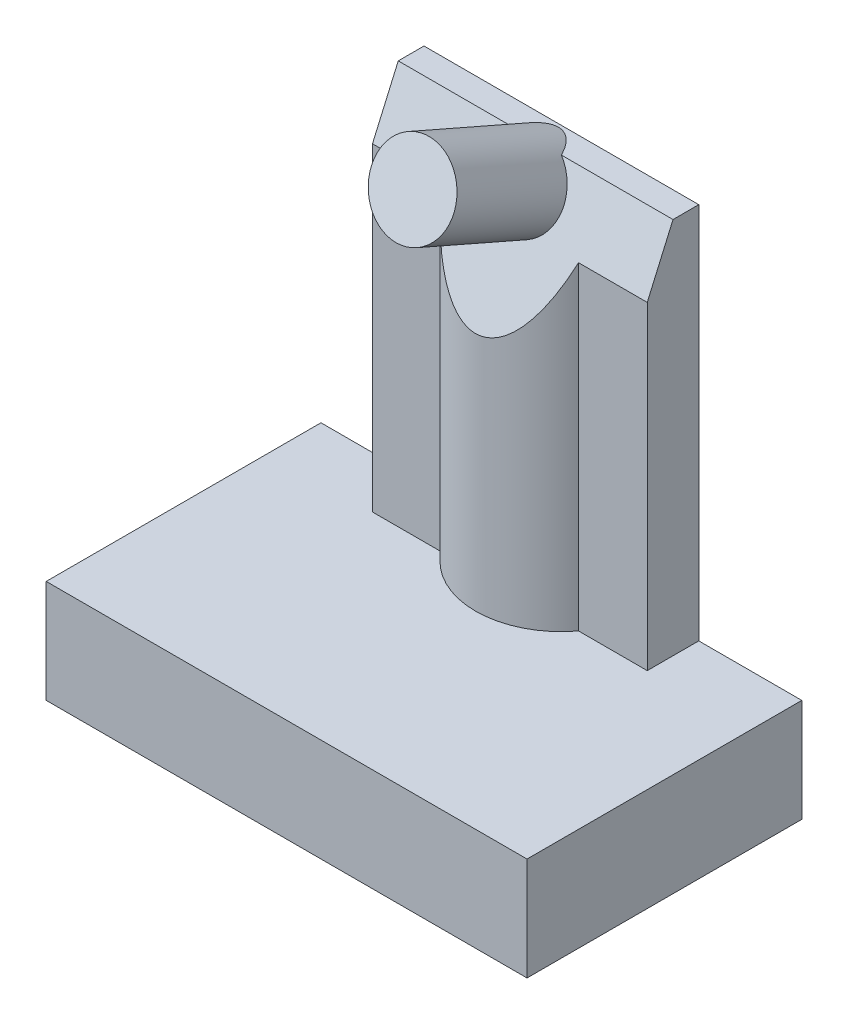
ISO-10303-21;
HEADER;
FILE_DESCRIPTION(('STEP AP214'),'2;1');
FILE_NAME('part.step','',(''),(''),'','','');
FILE_SCHEMA(('AUTOMOTIVE_DESIGN { 1 0 10303 214 1 1 1 1 }'));
ENDSEC;
DATA;
#1=APPLICATION_CONTEXT('core data for automotive mechanical design processes');
#2=APPLICATION_PROTOCOL_DEFINITION('international standard','automotive_design',2000,#1);
#3=PRODUCT_CONTEXT('',#1,'mechanical');
#4=PRODUCT('Part','Part','',(#3));
#5=PRODUCT_RELATED_PRODUCT_CATEGORY('part','',(#4));
#6=PRODUCT_DEFINITION_FORMATION('','',#4);
#7=PRODUCT_DEFINITION_CONTEXT('part definition',#1,'design');
#8=PRODUCT_DEFINITION('design','',#6,#7);
#9=PRODUCT_DEFINITION_SHAPE('','',#8);
#10=(LENGTH_UNIT() NAMED_UNIT(*) SI_UNIT(.MILLI.,.METRE.));
#11=(NAMED_UNIT(*) PLANE_ANGLE_UNIT() SI_UNIT($,.RADIAN.));
#12=(NAMED_UNIT(*) SI_UNIT($,.STERADIAN.) SOLID_ANGLE_UNIT());
#13=UNCERTAINTY_MEASURE_WITH_UNIT(LENGTH_MEASURE(1.E-05),#10,'distance_accuracy_value','');
#14=(GEOMETRIC_REPRESENTATION_CONTEXT(3) GLOBAL_UNCERTAINTY_ASSIGNED_CONTEXT((#13)) GLOBAL_UNIT_ASSIGNED_CONTEXT((#10,
#11,#12)) REPRESENTATION_CONTEXT('',''));
#15=CARTESIAN_POINT('',(0.,0.,0.));
#16=DIRECTION('',(0.,0.,1.));
#17=DIRECTION('',(1.,0.,0.));
#18=AXIS2_PLACEMENT_3D('',#15,#16,#17);
#19=CARTESIAN_POINT('',(0.,14.,-4.));
#20=DIRECTION('',(0.,1.,0.));
#21=DIRECTION('',(0.,0.,1.));
#22=AXIS2_PLACEMENT_3D('',#19,#20,#21);
#23=PLANE('',#22);
#24=DIRECTION('',(1.,0.,0.));
#25=VECTOR('',#24,1.);
#26=CARTESIAN_POINT('',(-8.36606229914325,14.,-3.25));
#27=LINE('',#26,#25);
#28=CARTESIAN_POINT('',(-4.,14.,-3.25));
#29=VERTEX_POINT('',#28);
#30=CARTESIAN_POINT('',(-0.751452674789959,14.,-3.25));
#31=VERTEX_POINT('',#30);
#32=EDGE_CURVE('E145',#29,#31,#27,.T.);
#33=ORIENTED_EDGE('',*,*,#32,.T.);
#34=CARTESIAN_POINT('',(0.,14.,-0.915816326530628));
#35=DIRECTION('',(0.,1.,0.));
#36=DIRECTION('',(0.,0.,-1.));
#37=AXIS2_PLACEMENT_3D('',#34,#35,#36);
#38=ELLIPSE('',#37,2.99387129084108,1.2);
#39=CARTESIAN_POINT('',(0.751452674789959,14.,-3.25));
#40=VERTEX_POINT('',#39);
#41=EDGE_CURVE('E148',#31,#40,#38,.F.);
#42=ORIENTED_EDGE('',*,*,#41,.T.);
#43=CARTESIAN_POINT('',(4.,14.,-3.25));
#44=VERTEX_POINT('',#43);
#45=EDGE_CURVE('E53',#40,#44,#27,.T.);
#46=ORIENTED_EDGE('',*,*,#45,.T.);
#47=DIRECTION('',(0.,0.,-1.));
#48=VECTOR('',#47,1.);
#49=CARTESIAN_POINT('',(4.,14.,-4.));
#50=LINE('',#49,#48);
#51=CARTESIAN_POINT('',(4.,14.,-4.));
#52=VERTEX_POINT('',#51);
#53=EDGE_CURVE('E176',#44,#52,#50,.T.);
#54=ORIENTED_EDGE('',*,*,#53,.T.);
#55=DIRECTION('',(-1.,0.,0.));
#56=VECTOR('',#55,1.);
#57=CARTESIAN_POINT('',(-4.,14.,-4.));
#58=LINE('',#57,#56);
#59=CARTESIAN_POINT('',(-4.,14.,-4.));
#60=VERTEX_POINT('',#59);
#61=EDGE_CURVE('E178',#52,#60,#58,.T.);
#62=ORIENTED_EDGE('',*,*,#61,.T.);
#63=DIRECTION('',(0.,0.,1.));
#64=VECTOR('',#63,1.);
#65=CARTESIAN_POINT('',(-4.,14.,-4.));
#66=LINE('',#65,#64);
#67=EDGE_CURVE('E181',#60,#29,#66,.T.);
#68=ORIENTED_EDGE('',*,*,#67,.T.);
#69=EDGE_LOOP('',(#33,#42,#46,#54,#62,#68));
#70=FACE_BOUND('',#69,.T.);
#71=ADVANCED_FACE('F33',(#70),#23,.T.);
#72=CARTESIAN_POINT('',(-8.36606229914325,10.,-1.5));
#73=DIRECTION('',(0.,-0.400818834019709,-0.916157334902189));
#74=DIRECTION('',(0.,0.916157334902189,-0.400818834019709));
#75=AXIS2_PLACEMENT_3D('',#72,#73,#74);
#76=PLANE('',#75);
#77=CARTESIAN_POINT('',(0.,13.1428571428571,-2.87500000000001));
#78=DIRECTION('',(0.,-0.400818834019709,-0.916157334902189));
#79=DIRECTION('',(0.,0.916157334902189,-0.400818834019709));
#80=AXIS2_PLACEMENT_3D('',#77,#78,#79);
#81=CIRCLE('',#80,1.2);
#82=EDGE_CURVE('E11',#31,#40,#81,.F.);
#83=ORIENTED_EDGE('',*,*,#82,.F.);
#84=ORIENTED_EDGE('',*,*,#32,.F.);
#85=DIRECTION('',(0.,-0.916157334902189,0.400818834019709));
#86=VECTOR('',#85,1.);
#87=CARTESIAN_POINT('',(-4.,10.,-1.5));
#88=LINE('',#87,#86);
#89=CARTESIAN_POINT('',(-4.,12.2857142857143,-2.5));
#90=VERTEX_POINT('',#89);
#91=EDGE_CURVE('E164',#29,#90,#88,.T.);
#92=ORIENTED_EDGE('',*,*,#91,.T.);
#93=DIRECTION('',(-1.,0.,0.));
#94=VECTOR('',#93,1.);
#95=CARTESIAN_POINT('',(-4.,12.2857142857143,-2.5));
#96=LINE('',#95,#94);
#97=CARTESIAN_POINT('',(-2.,12.2857142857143,-2.5));
#98=VERTEX_POINT('',#97);
#99=EDGE_CURVE('E166',#98,#90,#96,.T.);
#100=ORIENTED_EDGE('',*,*,#99,.F.);
#101=CARTESIAN_POINT('',(0.,15.7142857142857,-4.));
#102=DIRECTION('',(0.,-0.400818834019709,-0.916157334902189));
#103=DIRECTION('',(0.,-0.916157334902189,0.400818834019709));
#104=AXIS2_PLACEMENT_3D('',#101,#102,#103);
#105=ELLIPSE('',#104,6.23723185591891,2.5);
#106=CARTESIAN_POINT('',(2.,12.2857142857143,-2.5));
#107=VERTEX_POINT('',#106);
#108=EDGE_CURVE('E170',#107,#98,#105,.T.);
#109=ORIENTED_EDGE('',*,*,#108,.F.);
#110=DIRECTION('',(-1.,0.,0.));
#111=VECTOR('',#110,1.);
#112=CARTESIAN_POINT('',(4.,12.2857142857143,-2.5));
#113=LINE('',#112,#111);
#114=CARTESIAN_POINT('',(4.,12.2857142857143,-2.5));
#115=VERTEX_POINT('',#114);
#116=EDGE_CURVE('E172',#115,#107,#113,.T.);
#117=ORIENTED_EDGE('',*,*,#116,.F.);
#118=DIRECTION('',(0.,0.916157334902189,-0.400818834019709));
#119=VECTOR('',#118,1.);
#120=CARTESIAN_POINT('',(4.,10.,-1.5));
#121=LINE('',#120,#119);
#122=EDGE_CURVE('E143',#115,#44,#121,.T.);
#123=ORIENTED_EDGE('',*,*,#122,.T.);
#124=ORIENTED_EDGE('',*,*,#45,.F.);
#125=EDGE_LOOP('',(#83,#84,#92,#100,#109,#117,#123,#124));
#126=FACE_BOUND('',#125,.T.);
#127=ADVANCED_FACE('F141',(#126),#76,.F.);
#128=CARTESIAN_POINT('',(0.,2.,0.));
#129=DIRECTION('',(0.,1.,0.));
#130=DIRECTION('',(0.,0.,1.));
#131=AXIS2_PLACEMENT_3D('',#128,#129,#130);
#132=PLANE('',#131);
#133=DIRECTION('',(0.,0.,-1.));
#134=VECTOR('',#133,1.);
#135=CARTESIAN_POINT('',(6.,2.,-4.));
#136=LINE('',#135,#134);
#137=CARTESIAN_POINT('',(6.,2.,3.));
#138=VERTEX_POINT('',#137);
#139=CARTESIAN_POINT('',(6.,2.,-3.));
#140=VERTEX_POINT('',#139);
#141=EDGE_CURVE('E342',#138,#140,#136,.T.);
#142=ORIENTED_EDGE('',*,*,#141,.F.);
#143=DIRECTION('',(1.,0.,0.));
#144=VECTOR('',#143,1.);
#145=CARTESIAN_POINT('',(-7.,2.,3.));
#146=LINE('',#145,#144);
#147=CARTESIAN_POINT('',(-6.,2.,3.));
#148=VERTEX_POINT('',#147);
#149=EDGE_CURVE('E355',#148,#138,#146,.T.);
#150=ORIENTED_EDGE('',*,*,#149,.F.);
#151=DIRECTION('',(0.,0.,1.));
#152=VECTOR('',#151,1.);
#153=CARTESIAN_POINT('',(-6.,2.,-4.));
#154=LINE('',#153,#152);
#155=CARTESIAN_POINT('',(-6.,2.,-3.));
#156=VERTEX_POINT('',#155);
#157=EDGE_CURVE('E357',#156,#148,#154,.T.);
#158=ORIENTED_EDGE('',*,*,#157,.F.);
#159=DIRECTION('',(-1.,0.,0.));
#160=VECTOR('',#159,1.);
#161=CARTESIAN_POINT('',(-7.,2.,-3.));
#162=LINE('',#161,#160);
#163=EDGE_CURVE('E359',#140,#156,#162,.T.);
#164=ORIENTED_EDGE('',*,*,#163,.F.);
#165=EDGE_LOOP('',(#142,#150,#158,#164));
#166=FACE_BOUND('',#165,.T.);
#167=CARTESIAN_POINT('',(0.,2.,0.));
#168=DIRECTION('',(0.,1.,0.));
#169=DIRECTION('',(0.,0.,1.));
#170=AXIS2_PLACEMENT_3D('',#167,#168,#169);
#171=CIRCLE('',#170,1.5);
#172=CARTESIAN_POINT('',(0.,2.,1.5));
#173=VERTEX_POINT('',#172);
#174=EDGE_CURVE('E41',#173,#173,#171,.F.);
#175=ORIENTED_EDGE('',*,*,#174,.F.);
#176=EDGE_LOOP('',(#175));
#177=FACE_BOUND('',#176,.T.);
#178=ADVANCED_FACE('F262',(#166,#177),#132,.F.);
#179=CARTESIAN_POINT('',(7.,3.,-4.));
#180=DIRECTION('',(-1.,0.,0.));
#181=DIRECTION('',(0.,0.,1.));
#182=AXIS2_PLACEMENT_3D('',#179,#180,#181);
#183=PLANE('',#182);
#184=DIRECTION('',(0.,0.,-1.));
#185=VECTOR('',#184,1.);
#186=CARTESIAN_POINT('',(7.,0.,-4.));
#187=LINE('',#186,#185);
#188=CARTESIAN_POINT('',(7.,0.,4.));
#189=VERTEX_POINT('',#188);
#190=CARTESIAN_POINT('',(7.,0.,-4.));
#191=VERTEX_POINT('',#190);
#192=EDGE_CURVE('E237',#189,#191,#187,.T.);
#193=ORIENTED_EDGE('',*,*,#192,.T.);
#194=DIRECTION('',(0.,-1.,0.));
#195=VECTOR('',#194,1.);
#196=CARTESIAN_POINT('',(7.,3.,-4.));
#197=LINE('',#196,#195);
#198=CARTESIAN_POINT('',(7.,3.,-4.));
#199=VERTEX_POINT('',#198);
#200=EDGE_CURVE('E255',#199,#191,#197,.T.);
#201=ORIENTED_EDGE('',*,*,#200,.F.);
#202=DIRECTION('',(0.,0.,-1.));
#203=VECTOR('',#202,1.);
#204=CARTESIAN_POINT('',(7.,3.,-4.));
#205=LINE('',#204,#203);
#206=CARTESIAN_POINT('',(7.,3.,4.));
#207=VERTEX_POINT('',#206);
#208=EDGE_CURVE('E225',#207,#199,#205,.T.);
#209=ORIENTED_EDGE('',*,*,#208,.F.);
#210=DIRECTION('',(0.,-1.,0.));
#211=VECTOR('',#210,1.);
#212=CARTESIAN_POINT('',(7.,3.,4.));
#213=LINE('',#212,#211);
#214=EDGE_CURVE('E236',#207,#189,#213,.T.);
#215=ORIENTED_EDGE('',*,*,#214,.T.);
#216=EDGE_LOOP('',(#193,#201,#209,#215));
#217=FACE_BOUND('',#216,.T.);
#218=ADVANCED_FACE('F35',(#217),#183,.F.);
#219=CARTESIAN_POINT('',(-7.,3.,-4.));
#220=DIRECTION('',(0.,0.,1.));
#221=DIRECTION('',(1.,0.,0.));
#222=AXIS2_PLACEMENT_3D('',#219,#220,#221);
#223=PLANE('',#222);
#224=DIRECTION('',(-1.,0.,0.));
#225=VECTOR('',#224,1.);
#226=CARTESIAN_POINT('',(-7.,0.,-4.));
#227=LINE('',#226,#225);
#228=CARTESIAN_POINT('',(-7.,0.,-4.));
#229=VERTEX_POINT('',#228);
#230=EDGE_CURVE('E240',#191,#229,#227,.T.);
#231=ORIENTED_EDGE('',*,*,#230,.T.);
#232=DIRECTION('',(0.,-1.,0.));
#233=VECTOR('',#232,1.);
#234=CARTESIAN_POINT('',(-7.,3.,-4.));
#235=LINE('',#234,#233);
#236=CARTESIAN_POINT('',(-7.,3.,-4.));
#237=VERTEX_POINT('',#236);
#238=EDGE_CURVE('E252',#237,#229,#235,.T.);
#239=ORIENTED_EDGE('',*,*,#238,.F.);
#240=DIRECTION('',(-1.,0.,0.));
#241=VECTOR('',#240,1.);
#242=CARTESIAN_POINT('',(-7.,3.,-4.));
#243=LINE('',#242,#241);
#244=CARTESIAN_POINT('',(-4.,3.,-4.));
#245=VERTEX_POINT('',#244);
#246=EDGE_CURVE('E221',#245,#237,#243,.T.);
#247=ORIENTED_EDGE('',*,*,#246,.F.);
#248=DIRECTION('',(0.,-1.,0.));
#249=VECTOR('',#248,1.);
#250=CARTESIAN_POINT('',(-4.,14.,-4.));
#251=LINE('',#250,#249);
#252=EDGE_CURVE('E203',#60,#245,#251,.T.);
#253=ORIENTED_EDGE('',*,*,#252,.F.);
#254=ORIENTED_EDGE('',*,*,#61,.F.);
#255=DIRECTION('',(0.,-1.,0.));
#256=VECTOR('',#255,1.);
#257=CARTESIAN_POINT('',(4.,14.,-4.));
#258=LINE('',#257,#256);
#259=CARTESIAN_POINT('',(4.,3.,-4.));
#260=VERTEX_POINT('',#259);
#261=EDGE_CURVE('E200',#52,#260,#258,.T.);
#262=ORIENTED_EDGE('',*,*,#261,.T.);
#263=EDGE_CURVE('E224',#199,#260,#243,.T.);
#264=ORIENTED_EDGE('',*,*,#263,.F.);
#265=ORIENTED_EDGE('',*,*,#200,.T.);
#266=EDGE_LOOP('',(#231,#239,#247,#253,#254,#262,#264,#265));
#267=FACE_BOUND('',#266,.T.);
#268=ADVANCED_FACE('F271',(#267),#223,.F.);
#269=CARTESIAN_POINT('',(-7.,3.,-4.));
#270=DIRECTION('',(1.,0.,0.));
#271=DIRECTION('',(0.,0.,-1.));
#272=AXIS2_PLACEMENT_3D('',#269,#270,#271);
#273=PLANE('',#272);
#274=DIRECTION('',(0.,0.,1.));
#275=VECTOR('',#274,1.);
#276=CARTESIAN_POINT('',(-7.,0.,-4.));
#277=LINE('',#276,#275);
#278=CARTESIAN_POINT('',(-7.,0.,4.));
#279=VERTEX_POINT('',#278);
#280=EDGE_CURVE('E243',#229,#279,#277,.T.);
#281=ORIENTED_EDGE('',*,*,#280,.T.);
#282=DIRECTION('',(0.,-1.,0.));
#283=VECTOR('',#282,1.);
#284=CARTESIAN_POINT('',(-7.,3.,4.));
#285=LINE('',#284,#283);
#286=CARTESIAN_POINT('',(-7.,3.,4.));
#287=VERTEX_POINT('',#286);
#288=EDGE_CURVE('E249',#287,#279,#285,.T.);
#289=ORIENTED_EDGE('',*,*,#288,.F.);
#290=DIRECTION('',(0.,0.,1.));
#291=VECTOR('',#290,1.);
#292=CARTESIAN_POINT('',(-7.,3.,-4.));
#293=LINE('',#292,#291);
#294=EDGE_CURVE('E231',#237,#287,#293,.T.);
#295=ORIENTED_EDGE('',*,*,#294,.F.);
#296=ORIENTED_EDGE('',*,*,#238,.T.);
#297=EDGE_LOOP('',(#281,#289,#295,#296));
#298=FACE_BOUND('',#297,.T.);
#299=ADVANCED_FACE('F395',(#298),#273,.F.);
#300=CARTESIAN_POINT('',(-7.,3.,4.));
#301=DIRECTION('',(0.,0.,-1.));
#302=DIRECTION('',(-1.,0.,0.));
#303=AXIS2_PLACEMENT_3D('',#300,#301,#302);
#304=PLANE('',#303);
#305=DIRECTION('',(1.,0.,0.));
#306=VECTOR('',#305,1.);
#307=CARTESIAN_POINT('',(-7.,0.,4.));
#308=LINE('',#307,#306);
#309=EDGE_CURVE('E245',#279,#189,#308,.T.);
#310=ORIENTED_EDGE('',*,*,#309,.T.);
#311=ORIENTED_EDGE('',*,*,#214,.F.);
#312=DIRECTION('',(1.,0.,0.));
#313=VECTOR('',#312,1.);
#314=CARTESIAN_POINT('',(-7.,3.,4.));
#315=LINE('',#314,#313);
#316=EDGE_CURVE('E234',#287,#207,#315,.T.);
#317=ORIENTED_EDGE('',*,*,#316,.F.);
#318=ORIENTED_EDGE('',*,*,#288,.T.);
#319=EDGE_LOOP('',(#310,#311,#317,#318));
#320=FACE_BOUND('',#319,.T.);
#321=ADVANCED_FACE('F402',(#320),#304,.F.);
#322=CARTESIAN_POINT('',(0.,3.,0.));
#323=DIRECTION('',(0.,1.,0.));
#324=DIRECTION('',(0.,0.,1.));
#325=AXIS2_PLACEMENT_3D('',#322,#323,#324);
#326=PLANE('',#325);
#327=DIRECTION('',(0.,0.,1.));
#328=VECTOR('',#327,1.);
#329=CARTESIAN_POINT('',(-4.,3.,-4.));
#330=LINE('',#329,#328);
#331=CARTESIAN_POINT('',(-4.,3.,-2.5));
#332=VERTEX_POINT('',#331);
#333=EDGE_CURVE('E197',#245,#332,#330,.T.);
#334=ORIENTED_EDGE('',*,*,#333,.F.);
#335=ORIENTED_EDGE('',*,*,#246,.T.);
#336=ORIENTED_EDGE('',*,*,#294,.T.);
#337=ORIENTED_EDGE('',*,*,#316,.T.);
#338=ORIENTED_EDGE('',*,*,#208,.T.);
#339=ORIENTED_EDGE('',*,*,#263,.T.);
#340=DIRECTION('',(0.,0.,-1.));
#341=VECTOR('',#340,1.);
#342=CARTESIAN_POINT('',(4.,3.,-4.));
#343=LINE('',#342,#341);
#344=CARTESIAN_POINT('',(4.,3.,-2.5));
#345=VERTEX_POINT('',#344);
#346=EDGE_CURVE('E189',#345,#260,#343,.T.);
#347=ORIENTED_EDGE('',*,*,#346,.F.);
#348=DIRECTION('',(1.,0.,0.));
#349=VECTOR('',#348,1.);
#350=CARTESIAN_POINT('',(4.,3.,-2.5));
#351=LINE('',#350,#349);
#352=CARTESIAN_POINT('',(2.,3.,-2.5));
#353=VERTEX_POINT('',#352);
#354=EDGE_CURVE('E186',#353,#345,#351,.T.);
#355=ORIENTED_EDGE('',*,*,#354,.F.);
#356=CARTESIAN_POINT('',(0.,3.,-4.));
#357=DIRECTION('',(0.,1.,0.));
#358=DIRECTION('',(0.,0.,1.));
#359=AXIS2_PLACEMENT_3D('',#356,#357,#358);
#360=CIRCLE('',#359,2.5);
#361=CARTESIAN_POINT('',(-2.,3.,-2.5));
#362=VERTEX_POINT('',#361);
#363=EDGE_CURVE('E175',#362,#353,#360,.T.);
#364=ORIENTED_EDGE('',*,*,#363,.F.);
#365=DIRECTION('',(1.,0.,0.));
#366=VECTOR('',#365,1.);
#367=CARTESIAN_POINT('',(-4.,3.,-2.5));
#368=LINE('',#367,#366);
#369=EDGE_CURVE('E179',#332,#362,#368,.T.);
#370=ORIENTED_EDGE('',*,*,#369,.F.);
#371=EDGE_LOOP('',(#334,#335,#336,#337,#338,#339,#347,#355,#364,#370));
#372=FACE_BOUND('',#371,.T.);
#373=ADVANCED_FACE('F385',(#372),#326,.T.);
#374=CARTESIAN_POINT('',(0.,0.,0.));
#375=DIRECTION('',(0.,1.,0.));
#376=DIRECTION('',(0.,0.,1.));
#377=AXIS2_PLACEMENT_3D('',#374,#375,#376);
#378=PLANE('',#377);
#379=DIRECTION('',(1.,0.,0.));
#380=VECTOR('',#379,1.);
#381=CARTESIAN_POINT('',(-7.,0.,3.));
#382=LINE('',#381,#380);
#383=CARTESIAN_POINT('',(-6.,0.,3.));
#384=VERTEX_POINT('',#383);
#385=CARTESIAN_POINT('',(6.,0.,3.));
#386=VERTEX_POINT('',#385);
#387=EDGE_CURVE('E333',#384,#386,#382,.T.);
#388=ORIENTED_EDGE('',*,*,#387,.T.);
#389=DIRECTION('',(0.,0.,-1.));
#390=VECTOR('',#389,1.);
#391=CARTESIAN_POINT('',(6.,0.,-4.));
#392=LINE('',#391,#390);
#393=CARTESIAN_POINT('',(6.,0.,-3.));
#394=VERTEX_POINT('',#393);
#395=EDGE_CURVE('E351',#386,#394,#392,.T.);
#396=ORIENTED_EDGE('',*,*,#395,.T.);
#397=DIRECTION('',(-1.,0.,0.));
#398=VECTOR('',#397,1.);
#399=CARTESIAN_POINT('',(-7.,0.,-3.));
#400=LINE('',#399,#398);
#401=CARTESIAN_POINT('',(-6.,0.,-3.));
#402=VERTEX_POINT('',#401);
#403=EDGE_CURVE('E347',#394,#402,#400,.T.);
#404=ORIENTED_EDGE('',*,*,#403,.T.);
#405=DIRECTION('',(0.,0.,1.));
#406=VECTOR('',#405,1.);
#407=CARTESIAN_POINT('',(-6.,0.,-4.));
#408=LINE('',#407,#406);
#409=EDGE_CURVE('E343',#402,#384,#408,.T.);
#410=ORIENTED_EDGE('',*,*,#409,.T.);
#411=EDGE_LOOP('',(#388,#396,#404,#410));
#412=FACE_BOUND('',#411,.T.);
#413=ORIENTED_EDGE('',*,*,#192,.F.);
#414=ORIENTED_EDGE('',*,*,#309,.F.);
#415=ORIENTED_EDGE('',*,*,#280,.F.);
#416=ORIENTED_EDGE('',*,*,#230,.F.);
#417=EDGE_LOOP('',(#413,#414,#415,#416));
#418=FACE_BOUND('',#417,.T.);
#419=ADVANCED_FACE('F318',(#412,#418),#378,.F.);
#420=CARTESIAN_POINT('',(6.,3.,-4.));
#421=DIRECTION('',(-1.,0.,0.));
#422=DIRECTION('',(0.,0.,1.));
#423=AXIS2_PLACEMENT_3D('',#420,#421,#422);
#424=PLANE('',#423);
#425=ORIENTED_EDGE('',*,*,#395,.F.);
#426=DIRECTION('',(0.,-1.,0.));
#427=VECTOR('',#426,1.);
#428=CARTESIAN_POINT('',(6.,3.,3.));
#429=LINE('',#428,#427);
#430=EDGE_CURVE('E338',#138,#386,#429,.T.);
#431=ORIENTED_EDGE('',*,*,#430,.F.);
#432=ORIENTED_EDGE('',*,*,#141,.T.);
#433=DIRECTION('',(0.,-1.,0.));
#434=VECTOR('',#433,1.);
#435=CARTESIAN_POINT('',(6.,3.,-3.));
#436=LINE('',#435,#434);
#437=EDGE_CURVE('E241',#140,#394,#436,.T.);
#438=ORIENTED_EDGE('',*,*,#437,.T.);
#439=EDGE_LOOP('',(#425,#431,#432,#438));
#440=FACE_BOUND('',#439,.T.);
#441=ADVANCED_FACE('F314',(#440),#424,.T.);
#442=CARTESIAN_POINT('',(-7.,3.,-3.));
#443=DIRECTION('',(0.,0.,1.));
#444=DIRECTION('',(1.,0.,0.));
#445=AXIS2_PLACEMENT_3D('',#442,#443,#444);
#446=PLANE('',#445);
#447=ORIENTED_EDGE('',*,*,#403,.F.);
#448=ORIENTED_EDGE('',*,*,#437,.F.);
#449=ORIENTED_EDGE('',*,*,#163,.T.);
#450=DIRECTION('',(0.,-1.,0.));
#451=VECTOR('',#450,1.);
#452=CARTESIAN_POINT('',(-6.,3.,-3.));
#453=LINE('',#452,#451);
#454=EDGE_CURVE('E361',#156,#402,#453,.T.);
#455=ORIENTED_EDGE('',*,*,#454,.T.);
#456=EDGE_LOOP('',(#447,#448,#449,#455));
#457=FACE_BOUND('',#456,.T.);
#458=ADVANCED_FACE('F317',(#457),#446,.T.);
#459=CARTESIAN_POINT('',(-6.,3.,-4.));
#460=DIRECTION('',(1.,0.,0.));
#461=DIRECTION('',(0.,0.,-1.));
#462=AXIS2_PLACEMENT_3D('',#459,#460,#461);
#463=PLANE('',#462);
#464=ORIENTED_EDGE('',*,*,#409,.F.);
#465=ORIENTED_EDGE('',*,*,#454,.F.);
#466=ORIENTED_EDGE('',*,*,#157,.T.);
#467=DIRECTION('',(0.,-1.,0.));
#468=VECTOR('',#467,1.);
#469=CARTESIAN_POINT('',(-6.,3.,3.));
#470=LINE('',#469,#468);
#471=EDGE_CURVE('E335',#148,#384,#470,.T.);
#472=ORIENTED_EDGE('',*,*,#471,.T.);
#473=EDGE_LOOP('',(#464,#465,#466,#472));
#474=FACE_BOUND('',#473,.T.);
#475=ADVANCED_FACE('F322',(#474),#463,.T.);
#476=CARTESIAN_POINT('',(-7.,3.,3.));
#477=DIRECTION('',(0.,0.,-1.));
#478=DIRECTION('',(-1.,0.,0.));
#479=AXIS2_PLACEMENT_3D('',#476,#477,#478);
#480=PLANE('',#479);
#481=ORIENTED_EDGE('',*,*,#387,.F.);
#482=ORIENTED_EDGE('',*,*,#471,.F.);
#483=ORIENTED_EDGE('',*,*,#149,.T.);
#484=ORIENTED_EDGE('',*,*,#430,.T.);
#485=EDGE_LOOP('',(#481,#482,#483,#484));
#486=FACE_BOUND('',#485,.T.);
#487=ADVANCED_FACE('F309',(#486),#480,.T.);
#488=CARTESIAN_POINT('',(0.,0.,0.));
#489=DIRECTION('',(0.,-1.,0.));
#490=DIRECTION('',(0.,0.,-1.));
#491=AXIS2_PLACEMENT_3D('',#488,#489,#490);
#492=PLANE('',#491);
#493=CARTESIAN_POINT('',(0.,0.,0.));
#494=DIRECTION('',(0.,-1.,0.));
#495=DIRECTION('',(0.,0.,-1.));
#496=AXIS2_PLACEMENT_3D('',#493,#494,#495);
#497=CIRCLE('',#496,1.5);
#498=CARTESIAN_POINT('',(0.,0.,-1.5));
#499=VERTEX_POINT('',#498);
#500=EDGE_CURVE('E354',#499,#499,#497,.T.);
#501=ORIENTED_EDGE('',*,*,#500,.T.);
#502=EDGE_LOOP('',(#501));
#503=FACE_BOUND('',#502,.T.);
#504=CARTESIAN_POINT('',(0.,0.,0.));
#505=DIRECTION('',(0.,-1.,0.));
#506=DIRECTION('',(0.,0.,-1.));
#507=AXIS2_PLACEMENT_3D('',#504,#505,#506);
#508=CIRCLE('',#507,0.8);
#509=CARTESIAN_POINT('',(0.,0.,-0.8));
#510=VERTEX_POINT('',#509);
#511=EDGE_CURVE('E371',#510,#510,#508,.T.);
#512=ORIENTED_EDGE('',*,*,#511,.F.);
#513=EDGE_LOOP('',(#512));
#514=FACE_BOUND('',#513,.T.);
#515=ADVANCED_FACE('F306',(#503,#514),#492,.T.);
#516=CARTESIAN_POINT('',(0.,0.,0.));
#517=DIRECTION('',(0.,1.,0.));
#518=DIRECTION('',(0.,0.,1.));
#519=AXIS2_PLACEMENT_3D('',#516,#517,#518);
#520=CYLINDRICAL_SURFACE('',#519,1.5);
#521=ORIENTED_EDGE('',*,*,#500,.F.);
#522=EDGE_LOOP('',(#521));
#523=FACE_BOUND('',#522,.T.);
#524=ORIENTED_EDGE('',*,*,#174,.T.);
#525=EDGE_LOOP('',(#524));
#526=FACE_BOUND('',#525,.T.);
#527=ADVANCED_FACE('F260',(#523,#526),#520,.T.);
#528=CARTESIAN_POINT('',(0.,0.,0.));
#529=DIRECTION('',(0.,1.,0.));
#530=DIRECTION('',(0.,0.,1.));
#531=AXIS2_PLACEMENT_3D('',#528,#529,#530);
#532=CYLINDRICAL_SURFACE('',#531,0.8);
#533=ORIENTED_EDGE('',*,*,#511,.T.);
#534=EDGE_LOOP('',(#533));
#535=FACE_BOUND('',#534,.T.);
#536=CARTESIAN_POINT('',(0.,2.,0.));
#537=DIRECTION('',(0.,-1.,0.));
#538=DIRECTION('',(0.,0.,-1.));
#539=AXIS2_PLACEMENT_3D('',#536,#537,#538);
#540=CIRCLE('',#539,0.8);
#541=CARTESIAN_POINT('',(0.,2.,-0.8));
#542=VERTEX_POINT('',#541);
#543=EDGE_CURVE('E372',#542,#542,#540,.T.);
#544=ORIENTED_EDGE('',*,*,#543,.F.);
#545=EDGE_LOOP('',(#544));
#546=FACE_BOUND('',#545,.T.);
#547=ADVANCED_FACE('F279',(#535,#546),#532,.F.);
#548=ORIENTED_EDGE('',*,*,#543,.T.);
#549=EDGE_LOOP('',(#548));
#550=FACE_BOUND('',#549,.T.);
#551=ADVANCED_FACE('F266',(#550),#132,.F.);
#552=CARTESIAN_POINT('',(0.,14.,-4.));
#553=DIRECTION('',(0.,-1.,0.));
#554=DIRECTION('',(0.,0.,-1.));
#555=AXIS2_PLACEMENT_3D('',#552,#553,#554);
#556=CYLINDRICAL_SURFACE('',#555,2.5);
#557=ORIENTED_EDGE('',*,*,#108,.T.);
#558=DIRECTION('',(0.,-1.,0.));
#559=VECTOR('',#558,1.);
#560=CARTESIAN_POINT('',(-2.,14.,-2.5));
#561=LINE('',#560,#559);
#562=EDGE_CURVE('E183',#98,#362,#561,.T.);
#563=ORIENTED_EDGE('',*,*,#562,.T.);
#564=ORIENTED_EDGE('',*,*,#363,.T.);
#565=DIRECTION('',(0.,-1.,0.));
#566=VECTOR('',#565,1.);
#567=CARTESIAN_POINT('',(2.,14.,-2.5));
#568=LINE('',#567,#566);
#569=EDGE_CURVE('E208',#107,#353,#568,.T.);
#570=ORIENTED_EDGE('',*,*,#569,.F.);
#571=EDGE_LOOP('',(#557,#563,#564,#570));
#572=FACE_BOUND('',#571,.T.);
#573=ADVANCED_FACE('F278',(#572),#556,.T.);
#574=CARTESIAN_POINT('',(4.,14.,-2.5));
#575=DIRECTION('',(0.,0.,-1.));
#576=DIRECTION('',(-1.,0.,0.));
#577=AXIS2_PLACEMENT_3D('',#574,#575,#576);
#578=PLANE('',#577);
#579=DIRECTION('',(0.,-1.,0.));
#580=VECTOR('',#579,1.);
#581=CARTESIAN_POINT('',(4.,14.,-2.5));
#582=LINE('',#581,#580);
#583=EDGE_CURVE('E202',#115,#345,#582,.T.);
#584=ORIENTED_EDGE('',*,*,#583,.F.);
#585=ORIENTED_EDGE('',*,*,#116,.T.);
#586=ORIENTED_EDGE('',*,*,#569,.T.);
#587=ORIENTED_EDGE('',*,*,#354,.T.);
#588=EDGE_LOOP('',(#584,#585,#586,#587));
#589=FACE_BOUND('',#588,.T.);
#590=ADVANCED_FACE('F295',(#589),#578,.F.);
#591=CARTESIAN_POINT('',(4.,14.,-4.));
#592=DIRECTION('',(-1.,0.,0.));
#593=DIRECTION('',(0.,0.,1.));
#594=AXIS2_PLACEMENT_3D('',#591,#592,#593);
#595=PLANE('',#594);
#596=ORIENTED_EDGE('',*,*,#53,.F.);
#597=ORIENTED_EDGE('',*,*,#122,.F.);
#598=ORIENTED_EDGE('',*,*,#583,.T.);
#599=ORIENTED_EDGE('',*,*,#346,.T.);
#600=ORIENTED_EDGE('',*,*,#261,.F.);
#601=EDGE_LOOP('',(#596,#597,#598,#599,#600));
#602=FACE_BOUND('',#601,.T.);
#603=ADVANCED_FACE('F292',(#602),#595,.F.);
#604=CARTESIAN_POINT('',(-4.,14.,-4.));
#605=DIRECTION('',(1.,0.,0.));
#606=DIRECTION('',(0.,0.,-1.));
#607=AXIS2_PLACEMENT_3D('',#604,#605,#606);
#608=PLANE('',#607);
#609=DIRECTION('',(0.,-1.,0.));
#610=VECTOR('',#609,1.);
#611=CARTESIAN_POINT('',(-4.,14.,-2.5));
#612=LINE('',#611,#610);
#613=EDGE_CURVE('E211',#90,#332,#612,.T.);
#614=ORIENTED_EDGE('',*,*,#613,.F.);
#615=ORIENTED_EDGE('',*,*,#91,.F.);
#616=ORIENTED_EDGE('',*,*,#67,.F.);
#617=ORIENTED_EDGE('',*,*,#252,.T.);
#618=ORIENTED_EDGE('',*,*,#333,.T.);
#619=EDGE_LOOP('',(#614,#615,#616,#617,#618));
#620=FACE_BOUND('',#619,.T.);
#621=ADVANCED_FACE('F288',(#620),#608,.F.);
#622=CARTESIAN_POINT('',(-4.,14.,-2.5));
#623=DIRECTION('',(0.,0.,-1.));
#624=DIRECTION('',(-1.,0.,0.));
#625=AXIS2_PLACEMENT_3D('',#622,#623,#624);
#626=PLANE('',#625);
#627=ORIENTED_EDGE('',*,*,#562,.F.);
#628=ORIENTED_EDGE('',*,*,#99,.T.);
#629=ORIENTED_EDGE('',*,*,#613,.T.);
#630=ORIENTED_EDGE('',*,*,#369,.T.);
#631=EDGE_LOOP('',(#627,#628,#629,#630));
#632=FACE_BOUND('',#631,.T.);
#633=ADVANCED_FACE('F157',(#632),#626,.F.);
#634=CARTESIAN_POINT('',(0.,14.5457230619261,0.331550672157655));
#635=DIRECTION('',(0.,-0.400818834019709,-0.916157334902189));
#636=DIRECTION('',(0.,0.916157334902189,-0.400818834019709));
#637=AXIS2_PLACEMENT_3D('',#634,#635,#636);
#638=CYLINDRICAL_SURFACE('',#637,1.2);
#639=ORIENTED_EDGE('',*,*,#41,.F.);
#640=ORIENTED_EDGE('',*,*,#82,.T.);
#641=EDGE_LOOP('',(#639,#640));
#642=FACE_BOUND('',#641,.T.);
#643=CARTESIAN_POINT('',(0.,14.5457230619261,0.331550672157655));
#644=DIRECTION('',(0.,0.400818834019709,0.916157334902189));
#645=DIRECTION('',(0.,-0.916157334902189,0.400818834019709));
#646=AXIS2_PLACEMENT_3D('',#643,#644,#645);
#647=CIRCLE('',#646,1.2);
#648=CARTESIAN_POINT('',(0.,13.4463342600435,0.812533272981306));
#649=VERTEX_POINT('',#648);
#650=EDGE_CURVE('E151',#649,#649,#647,.T.);
#651=ORIENTED_EDGE('',*,*,#650,.F.);
#652=EDGE_LOOP('',(#651));
#653=FACE_BOUND('',#652,.T.);
#654=ADVANCED_FACE('F153',(#642,#653),#638,.T.);
#655=CARTESIAN_POINT('',(0.,14.5457230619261,0.331550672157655));
#656=DIRECTION('',(0.,0.400818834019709,0.916157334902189));
#657=DIRECTION('',(0.,-0.916157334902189,0.400818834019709));
#658=AXIS2_PLACEMENT_3D('',#655,#656,#657);
#659=PLANE('',#658);
#660=ORIENTED_EDGE('',*,*,#650,.T.);
#661=EDGE_LOOP('',(#660));
#662=FACE_BOUND('',#661,.T.);
#663=ADVANCED_FACE('F156',(#662),#659,.T.);
#664=CLOSED_SHELL('',(#71,#127,#178,#218,#268,#299,#321,#373,#419,#441,#458,#475,#487,#515,#527,
#547,#551,#573,#590,#603,#621,#633,#654,#663));
#665=MANIFOLD_SOLID_BREP('B2',#664);
#666=ADVANCED_BREP_SHAPE_REPRESENTATION('',(#18,#665),#14);
#667=SHAPE_DEFINITION_REPRESENTATION(#9,#666);
ENDSEC;
END-ISO-10303-21;
